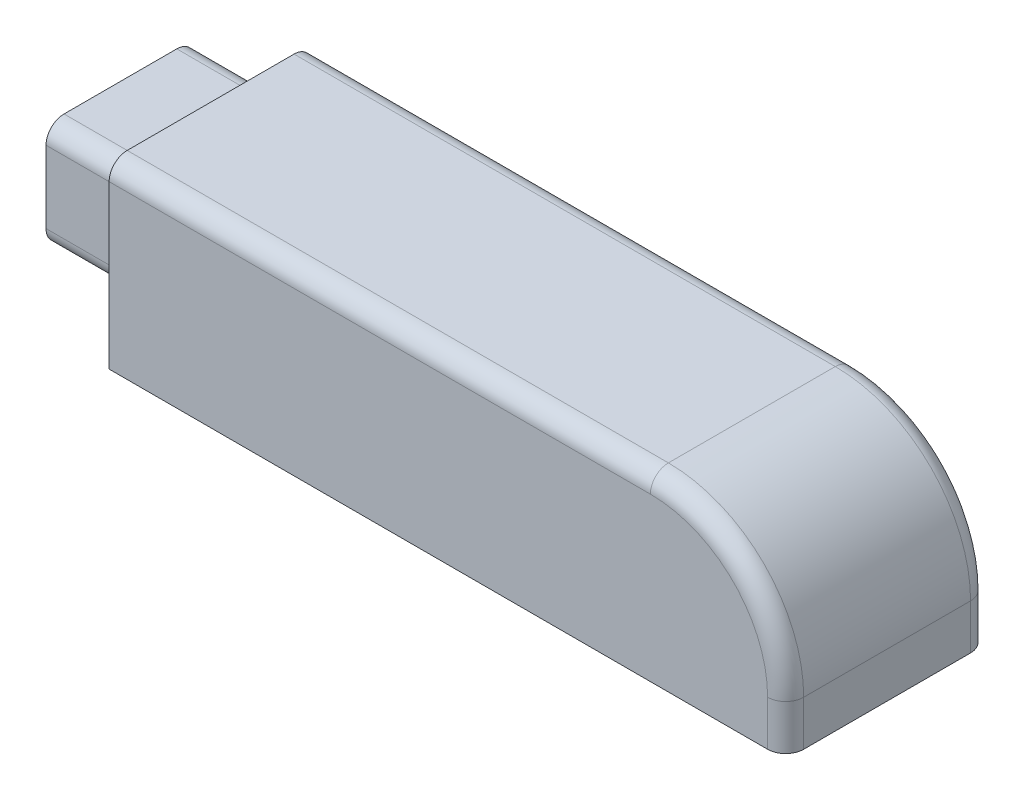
from build123d import *

# Parameters (mm, degrees)
SKIZZE1_W                       = 150
SKIZZE1_H                       = 45
AUFSATZ_LINEAR_AUSTRAGEN1_DEPTH = 40
SKIZZE8_W                       = 33
SKIZZE8_H                       = 24
AUFSATZ_LINEAR_AUSTRAGEN6_DEPTH = 20
SKIZZE10_W                      = 130
SKIZZE10_H                      = 17
SCHNITT_LINEAR_AUSTRAGEN4_DEPTH = 6
VERRUNDUNG1_R                   = 30
VERRUNDUNG2_R                   = 4
VERRUNDUNG3_R                   = 4


with BuildPart() as part:
    # Skizze1 → Aufsatz-Linear austragen1 (new body)
    with BuildSketch(Plane(origin=(0, 0, 0), x_dir=(1, 0, 0), z_dir=(0, 1, 0))):
        with Locations((35, 0)):
            Rectangle(SKIZZE1_W, SKIZZE1_H)
    extrude(amount=AUFSATZ_LINEAR_AUSTRAGEN1_DEPTH)

    # Skizze8 → Aufsatz-Linear austragen6 (add)
    with BuildSketch(Plane(origin=(-40, 0, 0), x_dir=(0, 0, -1), z_dir=(1, 0, 0))):
        with Locations((0, 22)):
            Rectangle(SKIZZE8_W, SKIZZE8_H)
    extrude(amount=-AUFSATZ_LINEAR_AUSTRAGEN6_DEPTH)

    # Skizze10 → Schnitt-Linear austragen4 (cut)
    with BuildSketch(Plane.XZ):
        with Locations((25, 0)):
            Rectangle(SKIZZE10_W, SKIZZE10_H)
    extrude(amount=-SCHNITT_LINEAR_AUSTRAGEN4_DEPTH, mode=Mode.SUBTRACT)

    # Verrundung1
    verrundung1_edges = [part.edges().sort_by_distance(p)[0] for p in [
        (110, 40, 0),
    ]]
    fillet(verrundung1_edges, radius=VERRUNDUNG1_R)

    # Verrundung2
    verrundung2_edges = [part.edges().sort_by_distance(p)[0] for p in [
        (20, 40, -22.5),
        (110, 5, -22.5),
        (101.213203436, 31.213203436, -22.5),
        (110, 5, 22.5),
        (101.213203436, 31.213203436, 22.5),
        (20, 40, 22.5),
    ]]
    fillet(verrundung2_edges, radius=VERRUNDUNG2_R)

    # Verrundung3
    verrundung3_edges = [part.edges().sort_by_distance(p)[0] for p in [
        (-50, 34, -16.5),
        (-50, 10, -16.5),
        (-50, 10, 16.5),
        (-50, 34, 16.5),
    ]]
    fillet(verrundung3_edges, radius=VERRUNDUNG3_R)


solid = part.part
